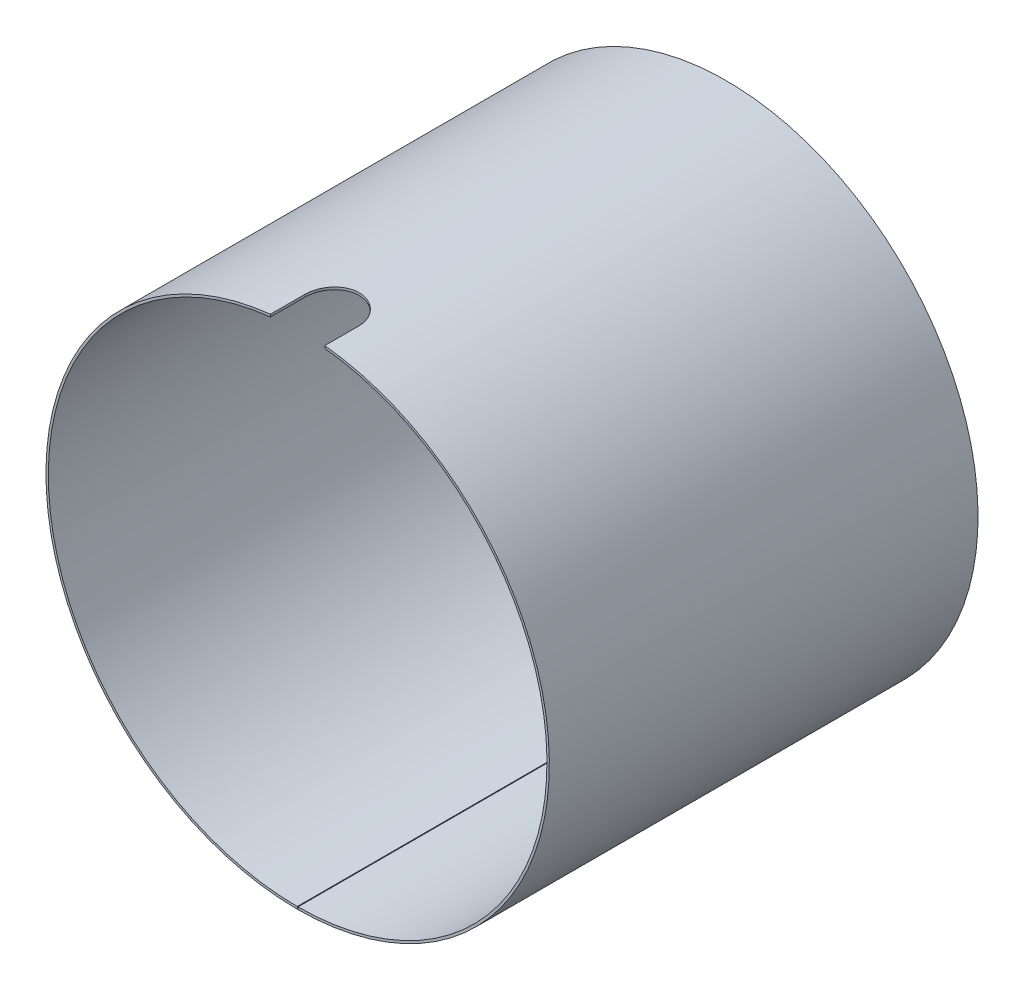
from build123d import *

# Parameters (mm, degrees)
SKETCH1_R             = 177.8
SKETCH1_R_2           = 154.000000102
EXTRUDE_THIN1_DEPTH   = 491.675999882
SKETCH3_R             = 163.2
CUT_EXTRUDE1_DEPTH    = 479.676000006
SKETCH4_OUTSIDE_W     = 498.262
SKETCH4_OUTSIDE_H     = 498.262
SKETCH4_OUTSIDE_R     = 166.7748
CUT_EXTRUDE2_DEPTH    = 484.675999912
M5X0_8_TAPPED_HOLE2_D = 5
CIRPATTERN2_COUNT     = 8
CUT_EXTRUDE3_DEPTH    = 200
SKETCH11_R            = 165.2
CUT_EXTRUDE4_DEPTH    = 479.676000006
CIRPATTERN1_COUNT     = 16
CUT_EXTRUDE10_START   = -4.7498
SKETCH18_R            = 165.2
CUT_EXTRUDE10_DEPTH   = 4.7498
SKETCH24_R            = 328.669570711
CUT_EXTRUDE17_DEPTH   = 546.796698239
SKETCH25_R            = 317.032963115
SKETCH25_R_2          = 166.7748
CUT_EXTRUDE18_DEPTH   = 4.7498
SKETCH26_R            = 464.280348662
CUT_EXTRUDE19_DEPTH   = 4.7498
CUT_EXTRUDE20_REACH   = 538.769
SKETCH28_W            = 0.508
SKETCH28_H            = 13.822020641
SKETCH30_W            = 544.992194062
SKETCH30_H            = 713.671222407
CUT_EXTRUDE22_DEPTH   = 198.12


with BuildPart() as part:
    # Sketch1 → Extrude-Thin1 (new body)
    with BuildSketch(Plane.XY):
        Circle(SKETCH1_R)
        Circle(SKETCH1_R_2, mode=Mode.SUBTRACT)
    extrude(amount=EXTRUDE_THIN1_DEPTH)

    # Sketch3 → Cut-Extrude1 (cut)
    with BuildSketch(Plane(origin=(0, 0, 0), x_dir=(-1, 0, 0), z_dir=(0, 0, -1))):
        Circle(SKETCH3_R)
    extrude(amount=-CUT_EXTRUDE1_DEPTH, mode=Mode.SUBTRACT)

    # Sketch4 outside → Cut-Extrude2 (cut)
    with BuildSketch(Plane.XY.offset(491.675999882)):
        Rectangle(SKETCH4_OUTSIDE_W, SKETCH4_OUTSIDE_H)
        Circle(SKETCH4_OUTSIDE_R, mode=Mode.SUBTRACT)
    extrude(amount=-CUT_EXTRUDE2_DEPTH, mode=Mode.SUBTRACT)

    # M5x0.8 Tapped Hole2 (through all)
    with Locations(Plane(origin=(30.97542686, 155.723986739, 491.675999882), x_dir=(1, 0, 0), z_dir=(0, 0, 1))):
        with Locations((0, 0)):
            m5x0_8_tapped_hole2 = Hole(M5X0_8_TAPPED_HOLE2_D / 2)

    # Sketch9 → M5x0.8 Tapped Hole1 (revolve, cut)
    with BuildSketch(Plane.YZ.offset(172.8)):
        Polygon((0, 0), (0, 15.6618073), (2.1, 14.4), (2.1, 12), (2.5, 12), (2.5, 0), align=None)
    m5x0_8_tapped_hole1 = revolve(axis=Axis((172.8, 0, -6.35), (0, 0, 1)), mode=Mode.SUBTRACT)

    # CirPattern2: M5x0.8 Tapped Hole1 ×8 about axis
    cirpattern2_axis = Axis((0, 0, 0), (0, 0, 1))
    for i in range(1, CIRPATTERN2_COUNT):
        add(m5x0_8_tapped_hole1.rotate(cirpattern2_axis, i * 360 / CIRPATTERN2_COUNT), mode=Mode.SUBTRACT)

    # Sketch10 → Cut-Extrude3 (cut)
    with BuildSketch(Plane(origin=(0, 0, 0), x_dir=(1, 0, 0), z_dir=(0, 1, 0))):
        with BuildLine():
            Line((-18, -511.675999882), (-18, -461.675999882))
            ThreePointArc((-18, -461.675999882), (0, -443.675999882), (18, -461.675999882))
            Line((18, -461.675999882), (18, -511.675999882))
            ThreePointArc((18, -511.675999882), (0, -529.675999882), (-18, -511.675999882))
        make_face()
    extrude(amount=CUT_EXTRUDE3_DEPTH, mode=Mode.SUBTRACT)

    # Sketch11 → Cut-Extrude4 (cut)
    with BuildSketch(Plane(origin=(0, 0, 479.676000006), x_dir=(-1, 0, 0), z_dir=(0, 0, -1))):
        with Locations(Location((0, 0, 0), (0, 0, 180))):
            Circle(SKETCH11_R)
    extrude(amount=CUT_EXTRUDE4_DEPTH, mode=Mode.SUBTRACT)

    # CirPattern1: M5x0.8 Tapped Hole2 ×16 about axis
    cirpattern1_axis = Axis((0, 0, 0), (0, 0, 1))
    for i in range(1, CIRPATTERN1_COUNT):
        add(m5x0_8_tapped_hole2.rotate(cirpattern1_axis, i * 360 / CIRPATTERN1_COUNT), mode=Mode.SUBTRACT)

    # Sketch18 → Cut-Extrude10 (cut)
    with BuildSketch(Plane(origin=(0, 0, 479.676000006), x_dir=(-1, 0, 0), z_dir=(0, 0, -1)).offset(CUT_EXTRUDE10_START)):
        with Locations(Location((0, 0, 0), (0, 0, 180))):
            Circle(SKETCH18_R)
    extrude(amount=CUT_EXTRUDE10_DEPTH, mode=Mode.SUBTRACT)

    # Sketch24 → Cut-Extrude17 (cut, through all)
    with BuildSketch(Plane(origin=(0, 0, 484.425800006), x_dir=(-1, 0, 0), z_dir=(0, 0, -1))):
        with Locations((-32.309346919, -30.662307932)):
            Circle(SKETCH24_R)
    extrude(amount=-CUT_EXTRUDE17_DEPTH, mode=Mode.SUBTRACT)

    # Sketch25 → Cut-Extrude18 (cut)
    with BuildSketch(Plane.XY.offset(6.99999997)):
        with Locations((-34.897797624, 30.357020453)):
            Circle(SKETCH25_R)
        Circle(SKETCH25_R_2, mode=Mode.SUBTRACT)
    extrude(amount=-CUT_EXTRUDE18_DEPTH, mode=Mode.SUBTRACT)

    # Sketch26 → Cut-Extrude19 (cut)
    with BuildSketch(Plane.XY.offset(2.25019997)):
        with Locations((-35.709041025, -24.949113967)):
            Circle(SKETCH26_R)
    extrude(amount=-CUT_EXTRUDE19_DEPTH, mode=Mode.SUBTRACT)

    # Sketch28 → Cut-Extrude20 (cut, up to next)
    with BuildSketch(Plane(origin=(0, 0, 2.25019997), x_dir=(-1, 0, 0), z_dir=(0, 0, -1)), mode=Mode.PRIVATE) as cut_extrude20_sk1:
        with Locations((0, -167.057141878)):
            Rectangle(SKETCH28_W, SKETCH28_H)
    cut_extrude20_tool1 = extrude(cut_extrude20_sk1.sketch, amount=-CUT_EXTRUDE20_REACH, mode=Mode.PRIVATE) & part.part
    add(cut_extrude20_tool1.solids().sort_by_distance((0, -167.057142, 2.2502))[0], mode=Mode.SUBTRACT)

    # Sketch30 → Cut-Extrude22 (cut)
    with BuildSketch(Plane(origin=(0, 0, 2.25019997), x_dir=(-1, 0, 0), z_dir=(0, 0, -1))):
        with Locations((-17.026791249, 60.107126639)):
            Rectangle(SKETCH30_W, SKETCH30_H)
    extrude(amount=-CUT_EXTRUDE22_DEPTH, mode=Mode.SUBTRACT)


solid = part.part
